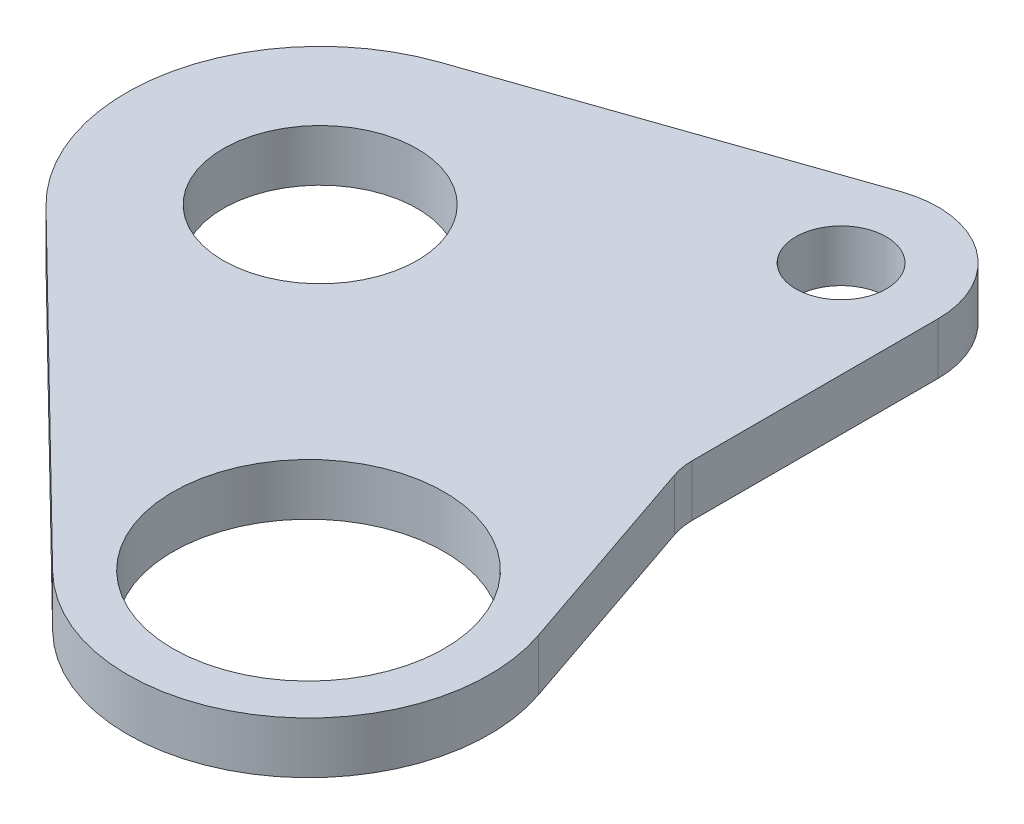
from build123d import *

# Parameters (mm, degrees)
ESQUISSE1_R      = 21
ESQUISSE1_R_2    = 15
ESQUISSE1_R_3    = 7
EXTRUSION1_DEPTH = 8


with BuildPart() as part:
    # Esquisse1 → Extrusion1 (new body)
    with BuildSketch(Plane(origin=(0, 0, 0), x_dir=(1, 0, 0), z_dir=(0, 1, 0))):
        with BuildLine():
            Line((-57.902209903, 78.253424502), (-4.901104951, 96.576712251))
            ThreePointArc((-4.901104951, 96.576712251), (8.702971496, 94.617130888), (15, 82.4))
            Line((15, 82.4), (15, 44.361196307))
            ThreePointArc((15, 44.361196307), (15.135187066, 42.722457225), (15.537093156, 41.128025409))
            Line((15.537093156, 41.128025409), (26.496139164, 9.052878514))
            ThreePointArc((26.496139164, 9.052878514), (14.933970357, -23.684943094), (-19.590105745, -20.005693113))
            Line((-19.590105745, -20.005693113), (-69.089399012, 28.465328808))
            ThreePointArc((-69.089399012, 28.465328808), (-77.37019667, 56.476897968), (-57.902209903, 78.253424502))
        make_face()
        with Locations(Location((0, 0, 0), (0, 0, 270))):
            Circle(ESQUISSE1_R, mode=Mode.SUBTRACT)
        with Locations(Location((-48.1, 49.9, 0), (0, 0, 270))):
            Circle(ESQUISSE1_R_2, mode=Mode.SUBTRACT)
        with Locations(Location((0, 82.4, 0), (0, 0, 270))):
            Circle(ESQUISSE1_R_3, mode=Mode.SUBTRACT)
    extrude(amount=EXTRUSION1_DEPTH)


solid = part.part
